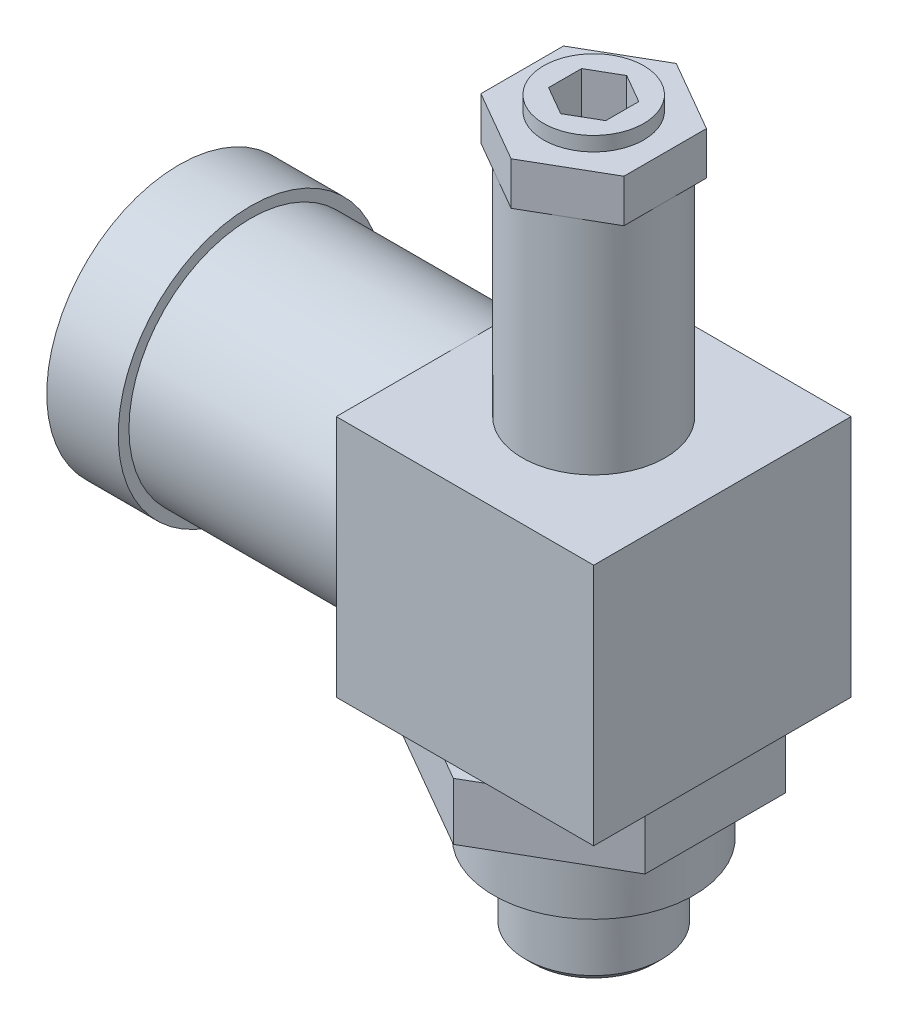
from build123d import *

# Parameters (mm, degrees)
ESQUISSE2_W             = 18
ESQUISSE2_H             = 17
EXTRUSION1_DEPTH        = 9
EXTRUSION2_DEPTH        = 3
ENL_V_MAT_EXTRU_1_DEPTH = 5
EXTRUSION3_DEPTH        = 4
CHANFREIN1_SIZE         = 0.5


with BuildPart() as part:
    # Esquisse1 → R_volution1 (revolve)
    with BuildSketch(Plane.XY, mode=Mode.PRIVATE) as r_volution1_sk:
        Polygon((-9, 0), (-24, 0), (-24, 2), (-32, 2), (-32, 4.25), (-30, 4.25), (-30, 3.5), (-29, 3.5), (-29, 9.25), (-24, 9.25), (-24, 8.5), (-9, 8.5), align=None)
    revolve(r_volution1_sk.sketch.rotate(Axis((-9, 0, 0), (1, 0, 0)), 180), axis=Axis((-9, 0, 0), (1, 0, 0)))

    # Esquisse2 → Extrusion1 (add, symmetric)
    with BuildSketch(Plane.XY):
        Rectangle(ESQUISSE2_W, ESQUISSE2_H)
    extrude(amount=EXTRUSION1_DEPTH, both=True)

    # Esquisse3 → R_volution2 (revolve)
    with BuildSketch(Plane.XY, mode=Mode.PRIVATE) as r_volution2_sk:
        Polygon((-5, -8.5), (-5, 24), (-3.5, 24), (-3.5, 28), (0, 28), (0, -22.5), (-4.75, -22.5), (-4.75, -17), (-7, -17), (-7, -8.5), align=None)
    revolve(r_volution2_sk.sketch.rotate(Axis((0, 0, 0), (0, 1, 0)), 270), axis=Axis((0, 0, 0), (0, 1, 0)))

    # Esquisse5 → Extrusion2 (add)
    with BuildSketch(Plane(origin=(0, 24, 0), x_dir=(-1, 0, 0), z_dir=(0, 1, 0))):
        Polygon((5, -2.886751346), (5, 2.886751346), (0, 5.773502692), (-5, 2.886751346), (-5, -2.886751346), (0, -5.773502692), align=None)
    extrude(amount=EXTRUSION2_DEPTH)

    # Esquisse4 → Enl_v. mat.-Extru.1 (cut)
    with BuildSketch(Plane(origin=(0, 28, 0), x_dir=(-1, 0, 0), z_dir=(0, 1, 0))):
        Polygon((0, 2.309401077), (-2, 1.154700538), (-2, -1.154700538), (0, -2.309401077), (2, -1.154700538), (2, 1.154700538), align=None)
    extrude(amount=-ENL_V_MAT_EXTRU_1_DEPTH, mode=Mode.SUBTRACT)

    # Esquisse6 → Extrusion3 (add)
    with BuildSketch(Plane.XZ.offset(8.5)):
        Polygon((0, 9.814954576), (-8.5, 4.907477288), (-8.5, -4.907477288), (0, -9.814954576), (8.5, -4.907477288), (8.5, 4.907477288), align=None)
    extrude(amount=EXTRUSION3_DEPTH)

    # Chanfrein1
    chanfrein1_edges = [part.edges().sort_by_distance(p)[0] for p in [
        (0, -22.5, 4.75),
    ]]
    chamfer(chanfrein1_edges, length=CHANFREIN1_SIZE)


solid = part.part
